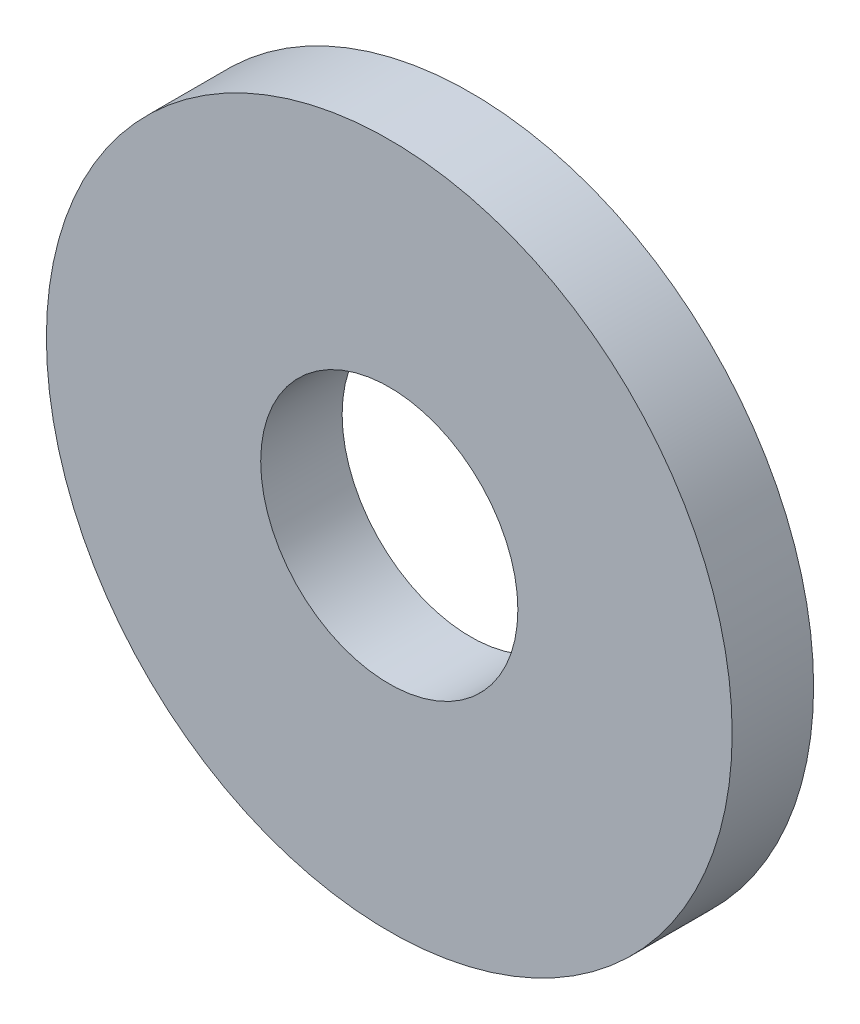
ISO-10303-21;
HEADER;
FILE_DESCRIPTION(('STEP AP214'),'2;1');
FILE_NAME('part.step','',(''),(''),'','','');
FILE_SCHEMA(('AUTOMOTIVE_DESIGN { 1 0 10303 214 1 1 1 1 }'));
ENDSEC;
DATA;
#1=APPLICATION_CONTEXT('core data for automotive mechanical design processes');
#2=APPLICATION_PROTOCOL_DEFINITION('international standard','automotive_design',2000,#1);
#3=PRODUCT_CONTEXT('',#1,'mechanical');
#4=PRODUCT('Part','Part','',(#3));
#5=PRODUCT_RELATED_PRODUCT_CATEGORY('part','',(#4));
#6=PRODUCT_DEFINITION_FORMATION('','',#4);
#7=PRODUCT_DEFINITION_CONTEXT('part definition',#1,'design');
#8=PRODUCT_DEFINITION('design','',#6,#7);
#9=PRODUCT_DEFINITION_SHAPE('','',#8);
#10=(LENGTH_UNIT() NAMED_UNIT(*) SI_UNIT(.MILLI.,.METRE.));
#11=(NAMED_UNIT(*) PLANE_ANGLE_UNIT() SI_UNIT($,.RADIAN.));
#12=(NAMED_UNIT(*) SI_UNIT($,.STERADIAN.) SOLID_ANGLE_UNIT());
#13=UNCERTAINTY_MEASURE_WITH_UNIT(LENGTH_MEASURE(1.E-05),#10,'distance_accuracy_value','');
#14=(GEOMETRIC_REPRESENTATION_CONTEXT(3) GLOBAL_UNCERTAINTY_ASSIGNED_CONTEXT((#13)) GLOBAL_UNIT_ASSIGNED_CONTEXT((#10,
#11,#12)) REPRESENTATION_CONTEXT('',''));
#15=CARTESIAN_POINT('',(0.,0.,0.));
#16=DIRECTION('',(0.,0.,1.));
#17=DIRECTION('',(1.,0.,0.));
#18=AXIS2_PLACEMENT_3D('',#15,#16,#17);
#19=CARTESIAN_POINT('',(0.,0.,1.9));
#20=DIRECTION('',(0.,0.,1.));
#21=DIRECTION('',(1.,0.,0.));
#22=AXIS2_PLACEMENT_3D('',#19,#20,#21);
#23=PLANE('',#22);
#24=CARTESIAN_POINT('',(0.,0.,1.9));
#25=DIRECTION('',(0.,0.,1.));
#26=DIRECTION('',(1.,0.,0.));
#27=AXIS2_PLACEMENT_3D('',#24,#25,#26);
#28=CIRCLE('',#27,8.);
#29=CARTESIAN_POINT('',(-8.,0.,1.9));
#30=VERTEX_POINT('',#29);
#31=EDGE_CURVE('E10',#30,#30,#28,.T.);
#32=ORIENTED_EDGE('',*,*,#31,.T.);
#33=EDGE_LOOP('',(#32));
#34=FACE_BOUND('',#33,.T.);
#35=CARTESIAN_POINT('',(0.,0.,1.9));
#36=DIRECTION('',(0.,0.,1.));
#37=DIRECTION('',(1.,0.,0.));
#38=AXIS2_PLACEMENT_3D('',#35,#36,#37);
#39=CIRCLE('',#38,3.);
#40=CARTESIAN_POINT('',(-3.,0.,1.9));
#41=VERTEX_POINT('',#40);
#42=EDGE_CURVE('E42',#41,#41,#39,.T.);
#43=ORIENTED_EDGE('',*,*,#42,.F.);
#44=EDGE_LOOP('',(#43));
#45=FACE_BOUND('',#44,.T.);
#46=ADVANCED_FACE('F31',(#34,#45),#23,.T.);
#47=CARTESIAN_POINT('',(0.,0.,0.));
#48=DIRECTION('',(0.,0.,1.));
#49=DIRECTION('',(1.,0.,0.));
#50=AXIS2_PLACEMENT_3D('',#47,#48,#49);
#51=PLANE('',#50);
#52=CARTESIAN_POINT('',(0.,0.,0.));
#53=DIRECTION('',(0.,0.,1.));
#54=DIRECTION('',(1.,0.,0.));
#55=AXIS2_PLACEMENT_3D('',#52,#53,#54);
#56=CIRCLE('',#55,8.);
#57=CARTESIAN_POINT('',(-8.,0.,0.));
#58=VERTEX_POINT('',#57);
#59=EDGE_CURVE('E38',#58,#58,#56,.T.);
#60=ORIENTED_EDGE('',*,*,#59,.F.);
#61=EDGE_LOOP('',(#60));
#62=FACE_BOUND('',#61,.T.);
#63=CARTESIAN_POINT('',(0.,0.,0.));
#64=DIRECTION('',(0.,0.,1.));
#65=DIRECTION('',(1.,0.,0.));
#66=AXIS2_PLACEMENT_3D('',#63,#64,#65);
#67=CIRCLE('',#66,3.);
#68=CARTESIAN_POINT('',(-3.,0.,0.));
#69=VERTEX_POINT('',#68);
#70=EDGE_CURVE('E46',#69,#69,#67,.T.);
#71=ORIENTED_EDGE('',*,*,#70,.T.);
#72=EDGE_LOOP('',(#71));
#73=FACE_BOUND('',#72,.T.);
#74=ADVANCED_FACE('F52',(#62,#73),#51,.F.);
#75=CARTESIAN_POINT('',(0.,0.,1.9));
#76=DIRECTION('',(0.,0.,-1.));
#77=DIRECTION('',(-1.,0.,0.));
#78=AXIS2_PLACEMENT_3D('',#75,#76,#77);
#79=CYLINDRICAL_SURFACE('',#78,8.);
#80=CARTESIAN_POINT('',(-8.,0.,1.9));
#81=CARTESIAN_POINT('',(-8.,0.,1.88020833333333));
#82=CARTESIAN_POINT('',(-8.,0.,1.86041666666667));
#83=CARTESIAN_POINT('',(-8.,0.,1.82083333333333));
#84=CARTESIAN_POINT('',(-8.,0.,1.80104166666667));
#85=CARTESIAN_POINT('',(-8.,0.,1.76145833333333));
#86=CARTESIAN_POINT('',(-8.,0.,1.74166666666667));
#87=CARTESIAN_POINT('',(-8.,0.,1.70208333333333));
#88=CARTESIAN_POINT('',(-8.,0.,1.68229166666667));
#89=CARTESIAN_POINT('',(-8.,0.,1.64270833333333));
#90=CARTESIAN_POINT('',(-8.,0.,1.62291666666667));
#91=CARTESIAN_POINT('',(-8.,0.,1.58333333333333));
#92=CARTESIAN_POINT('',(-8.,0.,1.56354166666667));
#93=CARTESIAN_POINT('',(-8.,0.,1.52395833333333));
#94=CARTESIAN_POINT('',(-8.,0.,1.50416666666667));
#95=CARTESIAN_POINT('',(-8.,0.,1.46458333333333));
#96=CARTESIAN_POINT('',(-8.,0.,1.44479166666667));
#97=CARTESIAN_POINT('',(-8.,0.,1.40520833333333));
#98=CARTESIAN_POINT('',(-8.,0.,1.38541666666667));
#99=CARTESIAN_POINT('',(-8.,0.,1.34583333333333));
#100=CARTESIAN_POINT('',(-8.,0.,1.32604166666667));
#101=CARTESIAN_POINT('',(-8.,0.,1.28645833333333));
#102=CARTESIAN_POINT('',(-8.,0.,1.26666666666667));
#103=CARTESIAN_POINT('',(-8.,0.,1.22708333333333));
#104=CARTESIAN_POINT('',(-8.,0.,1.20729166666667));
#105=CARTESIAN_POINT('',(-8.,0.,1.16770833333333));
#106=CARTESIAN_POINT('',(-8.,0.,1.14791666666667));
#107=CARTESIAN_POINT('',(-8.,0.,1.10833333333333));
#108=CARTESIAN_POINT('',(-8.,0.,1.08854166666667));
#109=CARTESIAN_POINT('',(-8.,0.,1.04895833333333));
#110=CARTESIAN_POINT('',(-8.,0.,1.02916666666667));
#111=CARTESIAN_POINT('',(-8.,0.,0.989583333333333));
#112=CARTESIAN_POINT('',(-8.,0.,0.969791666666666));
#113=CARTESIAN_POINT('',(-8.,0.,0.930208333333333));
#114=CARTESIAN_POINT('',(-8.,0.,0.910416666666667));
#115=CARTESIAN_POINT('',(-8.,0.,0.870833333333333));
#116=CARTESIAN_POINT('',(-8.,0.,0.851041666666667));
#117=CARTESIAN_POINT('',(-8.,0.,0.811458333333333));
#118=CARTESIAN_POINT('',(-8.,0.,0.791666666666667));
#119=CARTESIAN_POINT('',(-8.,0.,0.752083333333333));
#120=CARTESIAN_POINT('',(-8.,0.,0.732291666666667));
#121=CARTESIAN_POINT('',(-8.,0.,0.692708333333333));
#122=CARTESIAN_POINT('',(-8.,0.,0.672916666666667));
#123=CARTESIAN_POINT('',(-8.,0.,0.633333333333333));
#124=CARTESIAN_POINT('',(-8.,0.,0.613541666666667));
#125=CARTESIAN_POINT('',(-8.,0.,0.573958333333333));
#126=CARTESIAN_POINT('',(-8.,0.,0.554166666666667));
#127=CARTESIAN_POINT('',(-8.,0.,0.514583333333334));
#128=CARTESIAN_POINT('',(-8.,0.,0.494791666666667));
#129=CARTESIAN_POINT('',(-8.,0.,0.455208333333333));
#130=CARTESIAN_POINT('',(-8.,0.,0.435416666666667));
#131=CARTESIAN_POINT('',(-8.,0.,0.395833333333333));
#132=CARTESIAN_POINT('',(-8.,0.,0.376041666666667));
#133=CARTESIAN_POINT('',(-8.,0.,0.336458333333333));
#134=CARTESIAN_POINT('',(-8.,0.,0.316666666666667));
#135=CARTESIAN_POINT('',(-8.,0.,0.277083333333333));
#136=CARTESIAN_POINT('',(-8.,0.,0.257291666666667));
#137=CARTESIAN_POINT('',(-8.,0.,0.217708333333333));
#138=CARTESIAN_POINT('',(-8.,0.,0.197916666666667));
#139=CARTESIAN_POINT('',(-8.,0.,0.158333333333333));
#140=CARTESIAN_POINT('',(-8.,0.,0.138541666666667));
#141=CARTESIAN_POINT('',(-8.,0.,0.0989583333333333));
#142=CARTESIAN_POINT('',(-8.,0.,0.0791666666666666));
#143=CARTESIAN_POINT('',(-8.,0.,0.0395833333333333));
#144=CARTESIAN_POINT('',(-8.,0.,0.0197916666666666));
#145=CARTESIAN_POINT('',(-8.,0.,0.));
#146=B_SPLINE_CURVE_WITH_KNOTS('',3,(#80,#81,#82,#83,#84,#85,#86,#87,#88,#89,#90,#91,#92,#93,
#94,#95,#96,#97,#98,#99,#100,#101,#102,#103,#104,#105,#106,#107,#108,#109,#110,#111,#112,#113,
#114,#115,#116,#117,#118,#119,#120,#121,#122,#123,#124,#125,#126,#127,#128,#129,#130,#131,#132,
#133,#134,#135,#136,#137,#138,#139,#140,#141,#142,#143,#144,#145),.UNSPECIFIED.,.F.,.F.,(4,2,2,
2,2,2,2,2,2,2,2,2,2,2,2,2,2,2,2,2,2,2,2,2,2,2,2,2,2,2,2,2,4),(0.,0.0593750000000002,0.11875,
0.178125,0.2375,0.296875,0.35625,0.415625,0.475,0.534375,0.59375,0.653125,0.7125,0.771875,
0.83125,0.890625,0.95,1.009375,1.06875,1.128125,1.1875,1.246875,1.30625,1.365625,1.425,1.484375,
1.54375,1.603125,1.6625,1.721875,1.78125,1.840625,1.9),.UNSPECIFIED.);
#147=EDGE_CURVE('BSEAM33',#30,#58,#146,.T.);
#148=ORIENTED_EDGE('',*,*,#31,.F.);
#149=ORIENTED_EDGE('',*,*,#59,.T.);
#150=ORIENTED_EDGE('',*,*,#147,.T.);
#151=ORIENTED_EDGE('',*,*,#147,.F.);
#152=EDGE_LOOP('',(#148,#150,#149,#151));
#153=FACE_BOUND('',#152,.T.);
#154=ADVANCED_FACE('F33',(#153),#79,.T.);
#155=CARTESIAN_POINT('',(0.,0.,1.9));
#156=DIRECTION('',(0.,0.,-1.));
#157=DIRECTION('',(-1.,0.,0.));
#158=AXIS2_PLACEMENT_3D('',#155,#156,#157);
#159=CYLINDRICAL_SURFACE('',#158,3.);
#160=CARTESIAN_POINT('',(-3.,0.,1.9));
#161=CARTESIAN_POINT('',(-3.,0.,1.88020833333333));
#162=CARTESIAN_POINT('',(-3.,0.,1.86041666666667));
#163=CARTESIAN_POINT('',(-3.,0.,1.82083333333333));
#164=CARTESIAN_POINT('',(-3.,0.,1.80104166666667));
#165=CARTESIAN_POINT('',(-3.,0.,1.76145833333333));
#166=CARTESIAN_POINT('',(-3.,0.,1.74166666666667));
#167=CARTESIAN_POINT('',(-3.,0.,1.70208333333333));
#168=CARTESIAN_POINT('',(-3.,0.,1.68229166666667));
#169=CARTESIAN_POINT('',(-3.,0.,1.64270833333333));
#170=CARTESIAN_POINT('',(-3.,0.,1.62291666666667));
#171=CARTESIAN_POINT('',(-3.,0.,1.58333333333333));
#172=CARTESIAN_POINT('',(-3.,0.,1.56354166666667));
#173=CARTESIAN_POINT('',(-3.,0.,1.52395833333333));
#174=CARTESIAN_POINT('',(-3.,0.,1.50416666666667));
#175=CARTESIAN_POINT('',(-3.,0.,1.46458333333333));
#176=CARTESIAN_POINT('',(-3.,0.,1.44479166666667));
#177=CARTESIAN_POINT('',(-3.,0.,1.40520833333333));
#178=CARTESIAN_POINT('',(-3.,0.,1.38541666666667));
#179=CARTESIAN_POINT('',(-3.,0.,1.34583333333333));
#180=CARTESIAN_POINT('',(-3.,0.,1.32604166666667));
#181=CARTESIAN_POINT('',(-3.,0.,1.28645833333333));
#182=CARTESIAN_POINT('',(-3.,0.,1.26666666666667));
#183=CARTESIAN_POINT('',(-3.,0.,1.22708333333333));
#184=CARTESIAN_POINT('',(-3.,0.,1.20729166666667));
#185=CARTESIAN_POINT('',(-3.,0.,1.16770833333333));
#186=CARTESIAN_POINT('',(-3.,0.,1.14791666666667));
#187=CARTESIAN_POINT('',(-3.,0.,1.10833333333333));
#188=CARTESIAN_POINT('',(-3.,0.,1.08854166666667));
#189=CARTESIAN_POINT('',(-3.,0.,1.04895833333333));
#190=CARTESIAN_POINT('',(-3.,0.,1.02916666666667));
#191=CARTESIAN_POINT('',(-3.,0.,0.989583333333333));
#192=CARTESIAN_POINT('',(-3.,0.,0.969791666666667));
#193=CARTESIAN_POINT('',(-3.,0.,0.930208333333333));
#194=CARTESIAN_POINT('',(-3.,0.,0.910416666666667));
#195=CARTESIAN_POINT('',(-3.,0.,0.870833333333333));
#196=CARTESIAN_POINT('',(-3.,0.,0.851041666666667));
#197=CARTESIAN_POINT('',(-3.,0.,0.811458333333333));
#198=CARTESIAN_POINT('',(-3.,0.,0.791666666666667));
#199=CARTESIAN_POINT('',(-3.,0.,0.752083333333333));
#200=CARTESIAN_POINT('',(-3.,0.,0.732291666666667));
#201=CARTESIAN_POINT('',(-3.,0.,0.692708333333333));
#202=CARTESIAN_POINT('',(-3.,0.,0.672916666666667));
#203=CARTESIAN_POINT('',(-3.,0.,0.633333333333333));
#204=CARTESIAN_POINT('',(-3.,0.,0.613541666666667));
#205=CARTESIAN_POINT('',(-3.,0.,0.573958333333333));
#206=CARTESIAN_POINT('',(-3.,0.,0.554166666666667));
#207=CARTESIAN_POINT('',(-3.,0.,0.514583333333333));
#208=CARTESIAN_POINT('',(-3.,0.,0.494791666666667));
#209=CARTESIAN_POINT('',(-3.,0.,0.455208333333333));
#210=CARTESIAN_POINT('',(-3.,0.,0.435416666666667));
#211=CARTESIAN_POINT('',(-3.,0.,0.395833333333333));
#212=CARTESIAN_POINT('',(-3.,0.,0.376041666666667));
#213=CARTESIAN_POINT('',(-3.,0.,0.336458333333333));
#214=CARTESIAN_POINT('',(-3.,0.,0.316666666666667));
#215=CARTESIAN_POINT('',(-3.,0.,0.277083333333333));
#216=CARTESIAN_POINT('',(-3.,0.,0.257291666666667));
#217=CARTESIAN_POINT('',(-3.,0.,0.217708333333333));
#218=CARTESIAN_POINT('',(-3.,0.,0.197916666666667));
#219=CARTESIAN_POINT('',(-3.,0.,0.158333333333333));
#220=CARTESIAN_POINT('',(-3.,0.,0.138541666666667));
#221=CARTESIAN_POINT('',(-3.,0.,0.0989583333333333));
#222=CARTESIAN_POINT('',(-3.,0.,0.0791666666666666));
#223=CARTESIAN_POINT('',(-3.,0.,0.0395833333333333));
#224=CARTESIAN_POINT('',(-3.,0.,0.0197916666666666));
#225=CARTESIAN_POINT('',(-3.,0.,0.));
#226=B_SPLINE_CURVE_WITH_KNOTS('',3,(#160,#161,#162,#163,#164,#165,#166,#167,#168,#169,#170,
#171,#172,#173,#174,#175,#176,#177,#178,#179,#180,#181,#182,#183,#184,#185,#186,#187,#188,#189,
#190,#191,#192,#193,#194,#195,#196,#197,#198,#199,#200,#201,#202,#203,#204,#205,#206,#207,#208,
#209,#210,#211,#212,#213,#214,#215,#216,#217,#218,#219,#220,#221,#222,#223,#224,#225),
.UNSPECIFIED.,.F.,.F.,(4,2,2,2,2,2,2,2,2,2,2,2,2,2,2,2,2,2,2,2,2,2,2,2,2,2,2,2,2,2,2,2,4),(0.,
0.059375,0.11875,0.178125,0.2375,0.296875,0.35625,0.415625,0.475,0.534375,0.59375,0.653125,
0.7125,0.771875,0.83125,0.890625,0.95,1.009375,1.06875,1.128125,1.1875,1.246875,1.30625,
1.365625,1.425,1.484375,1.54375,1.603125,1.6625,1.721875,1.78125,1.840625,1.9),.UNSPECIFIED.);
#227=EDGE_CURVE('BSEAM54',#41,#69,#226,.T.);
#228=ORIENTED_EDGE('',*,*,#42,.T.);
#229=ORIENTED_EDGE('',*,*,#70,.F.);
#230=ORIENTED_EDGE('',*,*,#227,.T.);
#231=ORIENTED_EDGE('',*,*,#227,.F.);
#232=EDGE_LOOP('',(#228,#230,#229,#231));
#233=FACE_BOUND('',#232,.T.);
#234=ADVANCED_FACE('F54',(#233),#159,.F.);
#235=CLOSED_SHELL('',(#46,#74,#154,#234));
#236=MANIFOLD_SOLID_BREP('B2',#235);
#237=ADVANCED_BREP_SHAPE_REPRESENTATION('',(#18,#236),#14);
#238=SHAPE_DEFINITION_REPRESENTATION(#9,#237);
ENDSEC;
END-ISO-10303-21;
